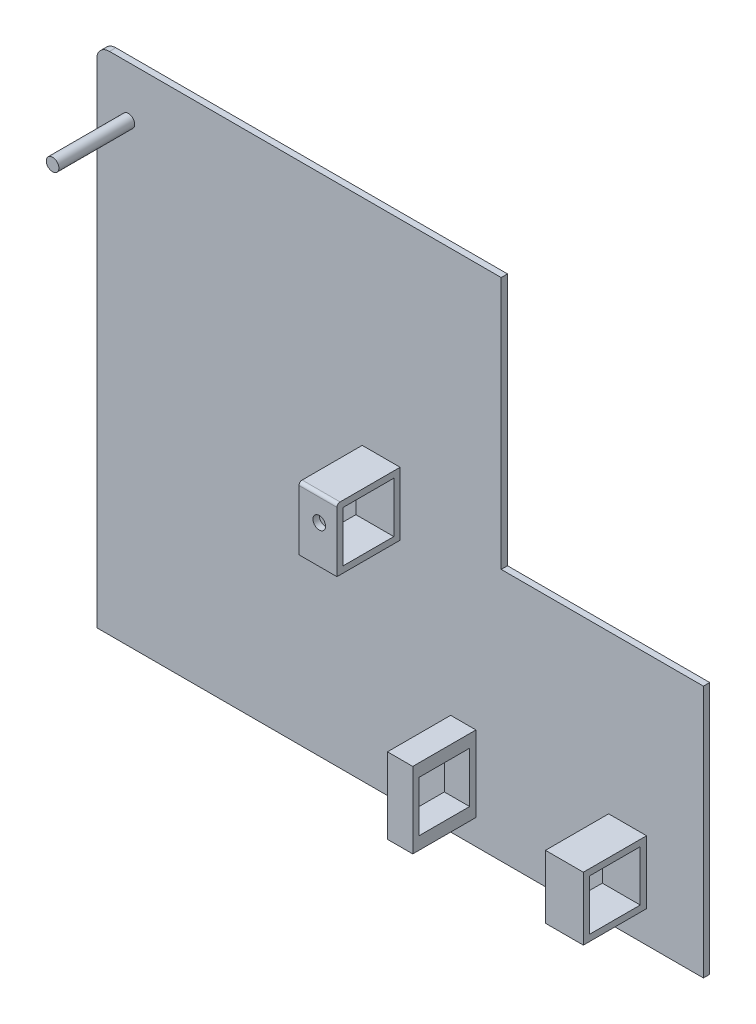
from build123d import *

# Parameters (mm, degrees)
EXTRUDE1_DEPTH      = 1.5875
EXTRUDE1_DEPTH_BACK = 1.5875
SKETCH2_R           = 3.175
EXTRUDE2_DEPTH      = 38.1
SKETCH3_W           = 31.75
SKETCH3_H           = 31.75
SKETCH3_W_2         = 25.4
SKETCH3_H_2         = 25.4
EXTRUDE3_DEPTH      = 9.525
SKETCH4_W           = 31.75
SKETCH4_H           = 38.1
SKETCH4_W_2         = 25.4
SKETCH4_H_2         = 25.4
EXTRUDE4_DEPTH      = 12.7
EXTRUDE5_DEPTH      = 9.525
EXTRUDE5_DEPTH_BACK = 9.525
SKETCH5_W           = 31.75
SKETCH5_H           = 31.75
SKETCH5_W_2         = 25.4
SKETCH5_H_2         = 25.4
SKETCH6_R           = 3.175
CUT_EXTRUDE1_DEPTH  = 3.175
FILLET1_R           = 6.35
FILLET2_R           = 1.5875


with BuildPart() as part:
    # Sketch1 → Extrude1 (new, two sides: drawn at the far end of the back side and taken through both)
    with BuildSketch(Plane.XY.offset(-EXTRUDE1_DEPTH_BACK)):
        Polygon((-38.1, 177.8), (165.1, 177.8), (165.1, 50.8), (266.7, 50.8), (266.7, -76.2), (-38.1, -76.2), align=None)
    extrude(amount=EXTRUDE1_DEPTH + EXTRUDE1_DEPTH_BACK)

    # Sketch2 → Extrude2 (add)
    with BuildSketch(Plane.XY.offset(1.5875)):
        with Locations(Location((-22.225, 152.4, 0), (0, 0, 180))):
            Circle(SKETCH2_R)
    extrude(amount=EXTRUDE2_DEPTH)

    # Sketch3 → Extrude3 (add, symmetric)
    with BuildSketch(Plane(origin=(228.6, 0, -1.5875), x_dir=(0, 0, -1), z_dir=(1, 0, 0))):
        with Locations((-19.05, -44.45)):
            Rectangle(SKETCH3_W, SKETCH3_H)
        with Locations((-19.05, -44.45)):
            Rectangle(SKETCH3_W_2, SKETCH3_H_2, mode=Mode.SUBTRACT)
    extrude(amount=EXTRUDE3_DEPTH, both=True)

    # Sketch5 → Extrude5 (add, two sides: drawn at the far end of the back side and taken through both)
    with BuildSketch(Plane(origin=(104.775, 0, -1.5875), x_dir=(0, 0, -1), z_dir=(1, 0, 0)).offset(-EXTRUDE5_DEPTH_BACK)):
        with Locations((-19.05, 53.975)):
            Rectangle(SKETCH5_W, SKETCH5_H)
        with Locations((-19.05, 53.975)):
            Rectangle(SKETCH5_W_2, SKETCH5_H_2, mode=Mode.SUBTRACT)
    extrude(amount=EXTRUDE5_DEPTH + EXTRUDE5_DEPTH_BACK)

    # Sketch6 → Cut-Extrude1 (cut)
    with BuildSketch(Plane.XY.offset(33.3375)):
        with Locations((105.41, 57.15)):
            Circle(SKETCH6_R)
    extrude(amount=-CUT_EXTRUDE1_DEPTH, mode=Mode.SUBTRACT)

    # Fillet1
    fillet1_edges = [part.edges().sort_by_distance(p)[0] for p in [
        (-38.1, 177.8, 0),
    ]]
    fillet(fillet1_edges, radius=FILLET1_R)

    # Fillet2
    fillet2_edges = [part.edges().sort_by_distance(p)[0] for p in [
        (104.775, 69.85, 33.3375),
    ]]
    fillet(fillet2_edges, radius=FILLET2_R)


with BuildPart() as body_2:
    # Sketch4 → Extrude4 (new body)
    with BuildSketch(Plane(origin=(139.7, 0, -1.5875), x_dir=(0, 0, -1), z_dir=(1, 0, 0))):
        with Locations((-19.05, -44.45)):
            Rectangle(SKETCH4_W, SKETCH4_H)
        with Locations((-19.05, -44.45)):
            Rectangle(SKETCH4_W_2, SKETCH4_H_2, mode=Mode.SUBTRACT)
    extrude(amount=EXTRUDE4_DEPTH)


solid = Compound([part.part, body_2.part])
